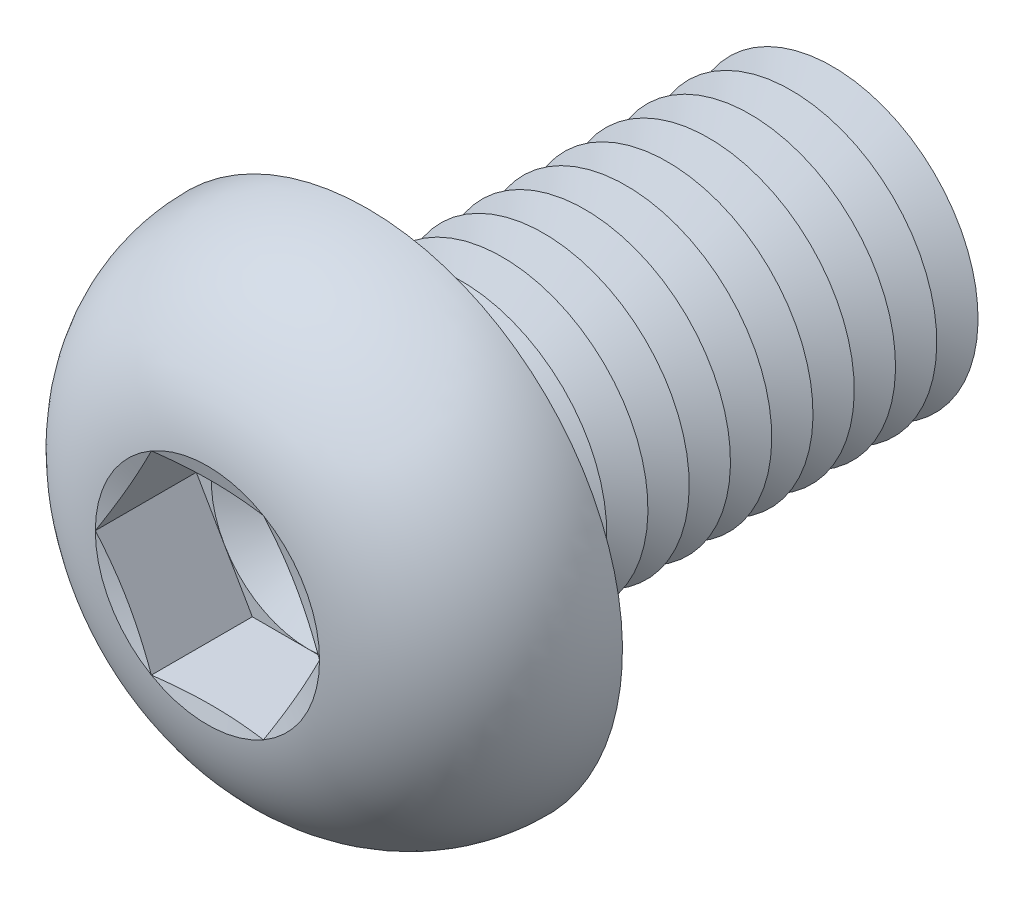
from build123d import *

# Parameters (mm, degrees)
FILLET1_R          = 0.85
LPATTERN1_COUNT    = 11
LPATTERN1_PITCH    = 1.7
CUT_EXTRUDE1_DEPTH = 4.16


with BuildPart() as part:
    # Sketch1 → Revolve1 (revolve)
    with BuildSketch(Plane(origin=(0, 0, 0), x_dir=(0, 0, -1), z_dir=(1, 0, 0))):
        with BuildLine():
            Line((0, 6), (0, 10.5))
            ThreePointArc((0, 10.5), (-4.420082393, 8.816378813), (-6.6, 4.6188))
            Line((-6.6, 4.6188), (-5.981198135, 2.3094))
            Line((-5.981198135, 2.3094), (-6.6, 2.3094))
            Line((-6.6, 2.3094), (-6.6, 0))
            Line((-6.6, 0), (20, 0))
            Line((20, 0), (20, 6))
            Line((20, 6), (0, 6))
        make_face()
    revolve(axis=Axis((0, 0, -20), (0, 0, 1)))

    # Fillet1
    fillet1_edges = [part.edges().sort_by_distance(p)[0] for p in [
        (0, -6, 0),
    ]]
    fillet(fillet1_edges, radius=FILLET1_R)

    # Sketch2 → Cut-Revolve1 (revolve, cut)
    with BuildSketch(Plane(origin=(0, 0, 0), x_dir=(0, 0, -1), z_dir=(1, 0, 0))):
        Polygon((19.15, 6), (20.85, 6), (20, 4.527756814), align=None)
    cut_revolve1 = revolve(axis=Axis((0, 0, -20), (0, 0, -1)), mode=Mode.SUBTRACT)

    # LPattern1: Cut-Revolve1 ×11
    with Locations(*[(0, 0, i * LPATTERN1_PITCH) for i in range(1, LPATTERN1_COUNT)]):
        add(cut_revolve1, mode=Mode.SUBTRACT)

    # Sketch3 → Cut-Extrude1 (cut)
    with BuildSketch(Plane.XY.offset(6.6)):
        Polygon((2.3094, 3.999998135), (-2.3094, 3.999998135), (-4.6188, 0), (-2.3094, -3.999998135), (2.3094, -3.999998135), (4.6188, 0), align=None)
    extrude(amount=-CUT_EXTRUDE1_DEPTH, mode=Mode.SUBTRACT)

    # Cut-Extrude2 cone 1 section (on through the dimple's axis) → Cut-Extrude2 (revolve, cut)
    with BuildSketch(Plane(origin=(0, 0, 2.44), x_dir=(0, -1, 0), z_dir=(1, 0, 0))):
        Polygon((0, 0), (3.999998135, 0), (0, 2.3094), align=None)
    revolve(axis=Axis((0, 0, 2.44), (0, 0, -1)), mode=Mode.SUBTRACT)


solid = part.part
